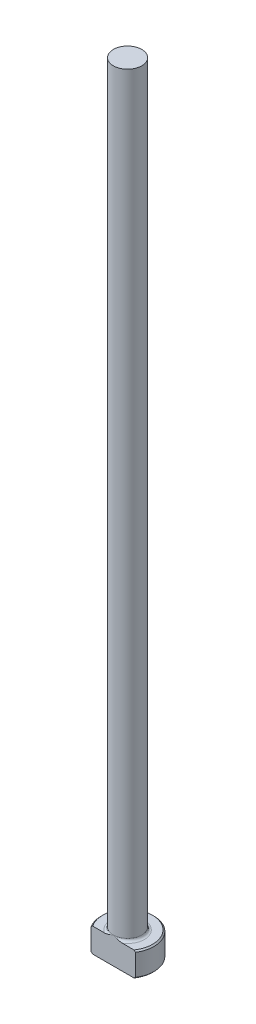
from build123d import *

# Parameters (mm, degrees)
CHAMFER1_SIZE = 0.254
FILLET1_R     = 0.508
KEY_DEPTH     = 153.574351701


with BuildPart() as part:
    # Sketch1 → Revolve1 (revolve)
    with BuildSketch(Plane.XY, mode=Mode.PRIVATE) as revolve1_sk:
        Polygon((0, 0), (-5.1562, 0), (-5.1562, 4.7498), (-2.77749, 4.7498), (-2.77749, 152.4), (0, 152.4), align=None)
    revolve(revolve1_sk.sketch.rotate(Axis((0, 259.958771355, 0), (0, -1, 0)), 270), axis=Axis((0, 259.958771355, 0), (0, -1, 0)))

    # Chamfer1
    chamfer1_edges = [part.edges().sort_by_distance(p)[0] for p in [
        (0, 4.7498, -5.1562),
        (0, 0, -5.1562),
    ]]
    chamfer(chamfer1_edges, length=CHAMFER1_SIZE)

    # Fillet1
    fillet1_edges = [part.edges().sort_by_distance(p)[0] for p in [
        (0, 4.7498, -2.77749),
    ]]
    fillet(fillet1_edges, radius=FILLET1_R)

    # Sketch2 → KEY (cut, through all)
    with BuildSketch(Plane.XZ):
        with BuildLine():
            Line((-4.344185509, 2.77749), (4.344185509, 2.77749))
            ThreePointArc((4.344185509, 2.77749), (0, 5.1562), (-4.344185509, 2.77749))
        make_face()
    extrude(amount=-KEY_DEPTH, mode=Mode.SUBTRACT)


solid = part.part
